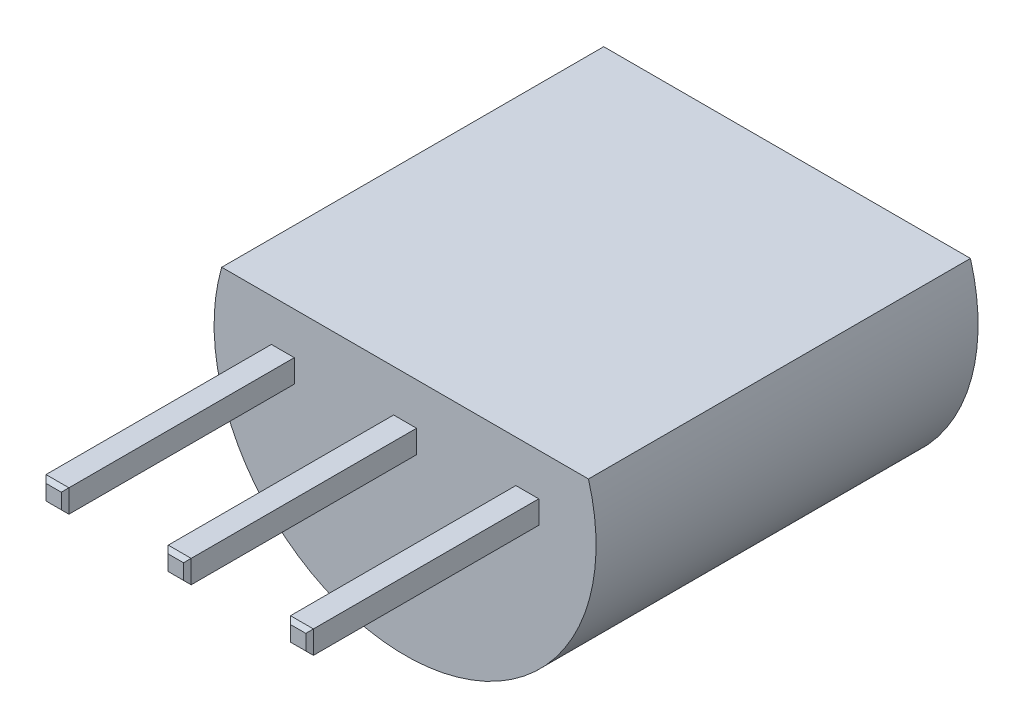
from build123d import *

# Parameters (mm, degrees)
ESQUISSE2_R             = 2.5
EXTRUSION1_DEPTH        = 5
ESQUISSE5_W             = 0.3
ESQUISSE5_H             = 0.3
EXTRUSION3_DEPTH        = 3
CHANFREIN1_SIZE         = 0.05
ESQUISSE6_W             = 5.511729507
ESQUISSE6_H             = 2.232022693
ENL_V_MAT_EXTRU_2_DEPTH = 9.746427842


with BuildPart() as part:
    # Esquisse2 → Extrusion1 (new body)
    with BuildSketch(Plane.XY):
        Circle(ESQUISSE2_R)
    extrude(amount=-EXTRUSION1_DEPTH)

    # Esquisse5 → Extrusion3 (add)
    with BuildSketch(Plane.XY):
        with Locations((-1.6, 0)):
            Rectangle(ESQUISSE5_W, ESQUISSE5_H)
        with Locations((1.6, 0)):
            Rectangle(ESQUISSE5_W, ESQUISSE5_H)
        Rectangle(ESQUISSE5_W, ESQUISSE5_H)
    extrude(amount=EXTRUSION3_DEPTH)

    # Chanfrein1
    chanfrein1_edges = [part.edges().sort_by_distance(p)[0] for p in [
        (1.6, 0.15, 3),
        (1.45, 0, 3),
        (1.6, -0.15, 3),
        (1.75, 0, 3),
        (-0.15, 0, 3),
        (0, -0.15, 3),
        (0.15, 0, 3),
        (0, 0.15, 3),
        (-1.45, 0, 3),
        (-1.6, 0.15, 3),
        (-1.75, 0, 3),
        (-1.6, -0.15, 3),
    ]]
    chamfer(chanfrein1_edges, length=CHANFREIN1_SIZE)

    # Esquisse6 → Enl_v. mat.-Extru.2 (cut, through all)
    with BuildSketch(Plane(origin=(0, 0, -5), x_dir=(-1, 0, 0), z_dir=(0, 0, -1))):
        with Locations((-0.072123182, 1.816011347)):
            Rectangle(ESQUISSE6_W, ESQUISSE6_H)
    extrude(amount=-ENL_V_MAT_EXTRU_2_DEPTH, mode=Mode.SUBTRACT)


solid = part.part
